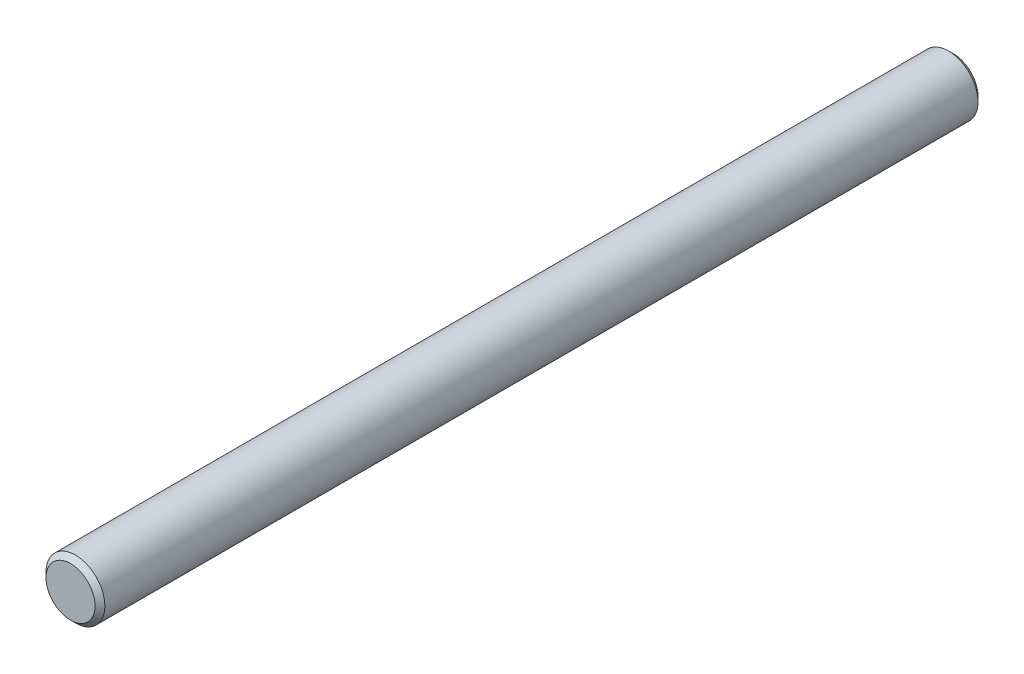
ISO-10303-21;
HEADER;
FILE_DESCRIPTION(('STEP AP214'),'2;1');
FILE_NAME('part.step','',(''),(''),'','','');
FILE_SCHEMA(('AUTOMOTIVE_DESIGN { 1 0 10303 214 1 1 1 1 }'));
ENDSEC;
DATA;
#1=APPLICATION_CONTEXT('core data for automotive mechanical design processes');
#2=APPLICATION_PROTOCOL_DEFINITION('international standard','automotive_design',2000,#1);
#3=PRODUCT_CONTEXT('',#1,'mechanical');
#4=PRODUCT('Part','Part','',(#3));
#5=PRODUCT_RELATED_PRODUCT_CATEGORY('part','',(#4));
#6=PRODUCT_DEFINITION_FORMATION('','',#4);
#7=PRODUCT_DEFINITION_CONTEXT('part definition',#1,'design');
#8=PRODUCT_DEFINITION('design','',#6,#7);
#9=PRODUCT_DEFINITION_SHAPE('','',#8);
#10=(LENGTH_UNIT() NAMED_UNIT(*) SI_UNIT(.MILLI.,.METRE.));
#11=(NAMED_UNIT(*) PLANE_ANGLE_UNIT() SI_UNIT($,.RADIAN.));
#12=(NAMED_UNIT(*) SI_UNIT($,.STERADIAN.) SOLID_ANGLE_UNIT());
#13=UNCERTAINTY_MEASURE_WITH_UNIT(LENGTH_MEASURE(1.E-05),#10,'distance_accuracy_value','');
#14=(GEOMETRIC_REPRESENTATION_CONTEXT(3) GLOBAL_UNCERTAINTY_ASSIGNED_CONTEXT((#13)) GLOBAL_UNIT_ASSIGNED_CONTEXT((#10,
#11,#12)) REPRESENTATION_CONTEXT('',''));
#15=CARTESIAN_POINT('',(0.,0.,0.));
#16=DIRECTION('',(0.,0.,1.));
#17=DIRECTION('',(1.,0.,0.));
#18=AXIS2_PLACEMENT_3D('',#15,#16,#17);
#19=CARTESIAN_POINT('',(0.,0.,180.));
#20=DIRECTION('',(0.,0.,1.));
#21=DIRECTION('',(1.,0.,0.));
#22=AXIS2_PLACEMENT_3D('',#19,#20,#21);
#23=PLANE('',#22);
#24=CARTESIAN_POINT('',(0.,0.,180.000000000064));
#25=DIRECTION('',(0.,0.,-1.));
#26=DIRECTION('',(-1.,0.,0.));
#27=AXIS2_PLACEMENT_3D('',#24,#25,#26);
#28=CIRCLE('',#27,4.99999999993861);
#29=CARTESIAN_POINT('',(-4.99999999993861,0.,180.000000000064));
#30=VERTEX_POINT('',#29);
#31=EDGE_CURVE('E18',#30,#30,#28,.T.);
#32=ORIENTED_EDGE('',*,*,#31,.F.);
#33=EDGE_LOOP('',(#32));
#34=FACE_BOUND('',#33,.T.);
#35=ADVANCED_FACE('F15',(#34),#23,.T.);
#36=CARTESIAN_POINT('',(0.,0.,0.));
#37=DIRECTION('',(0.,0.,1.));
#38=DIRECTION('',(1.,0.,0.));
#39=AXIS2_PLACEMENT_3D('',#36,#37,#38);
#40=PLANE('',#39);
#41=CARTESIAN_POINT('',(0.,0.,0.));
#42=DIRECTION('',(0.,0.,1.));
#43=DIRECTION('',(1.,0.,0.));
#44=AXIS2_PLACEMENT_3D('',#41,#42,#43);
#45=CIRCLE('',#44,4.99999999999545);
#46=CARTESIAN_POINT('',(4.99999999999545,0.,0.));
#47=VERTEX_POINT('',#46);
#48=EDGE_CURVE('E27',#47,#47,#45,.T.);
#49=ORIENTED_EDGE('',*,*,#48,.F.);
#50=EDGE_LOOP('',(#49));
#51=FACE_BOUND('',#50,.T.);
#52=ADVANCED_FACE('F43',(#51),#40,.F.);
#53=CARTESIAN_POINT('',(0.,0.,179.00000000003));
#54=DIRECTION('',(0.,0.,-1.));
#55=DIRECTION('',(-1.,0.,0.));
#56=AXIS2_PLACEMENT_3D('',#53,#54,#55);
#57=CONICAL_SURFACE('',#56,5.99999999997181,0.785398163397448);
#58=ORIENTED_EDGE('',*,*,#31,.T.);
#59=EDGE_LOOP('',(#58));
#60=FACE_BOUND('',#59,.T.);
#61=CARTESIAN_POINT('',(0.,0.,179.));
#62=DIRECTION('',(0.,0.,1.));
#63=DIRECTION('',(1.,0.,0.));
#64=AXIS2_PLACEMENT_3D('',#61,#62,#63);
#65=CIRCLE('',#64,6.);
#66=CARTESIAN_POINT('',(6.,0.,179.));
#67=VERTEX_POINT('',#66);
#68=EDGE_CURVE('E22',#67,#67,#65,.F.);
#69=ORIENTED_EDGE('',*,*,#68,.F.);
#70=EDGE_LOOP('',(#69));
#71=FACE_BOUND('',#70,.T.);
#72=ADVANCED_FACE('F39',(#60,#71),#57,.T.);
#73=CARTESIAN_POINT('',(0.,0.,1.0000000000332));
#74=DIRECTION('',(0.,0.,1.));
#75=DIRECTION('',(1.,0.,0.));
#76=AXIS2_PLACEMENT_3D('',#73,#74,#75);
#77=CONICAL_SURFACE('',#76,5.99999999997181,0.785398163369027);
#78=ORIENTED_EDGE('',*,*,#48,.T.);
#79=EDGE_LOOP('',(#78));
#80=FACE_BOUND('',#79,.T.);
#81=CARTESIAN_POINT('',(0.,0.,1.));
#82=DIRECTION('',(0.,0.,1.));
#83=DIRECTION('',(1.,0.,0.));
#84=AXIS2_PLACEMENT_3D('',#81,#82,#83);
#85=CIRCLE('',#84,6.);
#86=CARTESIAN_POINT('',(6.,0.,1.));
#87=VERTEX_POINT('',#86);
#88=EDGE_CURVE('E10',#87,#87,#85,.T.);
#89=ORIENTED_EDGE('',*,*,#88,.F.);
#90=EDGE_LOOP('',(#89));
#91=FACE_BOUND('',#90,.T.);
#92=ADVANCED_FACE('F51',(#80,#91),#77,.T.);
#93=CARTESIAN_POINT('',(0.,0.,0.));
#94=DIRECTION('',(0.,0.,1.));
#95=DIRECTION('',(1.,0.,0.));
#96=AXIS2_PLACEMENT_3D('',#93,#94,#95);
#97=CYLINDRICAL_SURFACE('',#96,6.);
#98=ORIENTED_EDGE('',*,*,#88,.T.);
#99=EDGE_LOOP('',(#98));
#100=FACE_BOUND('',#99,.T.);
#101=ORIENTED_EDGE('',*,*,#68,.T.);
#102=EDGE_LOOP('',(#101));
#103=FACE_BOUND('',#102,.T.);
#104=ADVANCED_FACE('F49',(#100,#103),#97,.T.);
#105=CLOSED_SHELL('',(#35,#52,#72,#92,#104));
#106=MANIFOLD_SOLID_BREP('B1',#105);
#107=ADVANCED_BREP_SHAPE_REPRESENTATION('',(#18,#106),#14);
#108=SHAPE_DEFINITION_REPRESENTATION(#9,#107);
ENDSEC;
END-ISO-10303-21;
